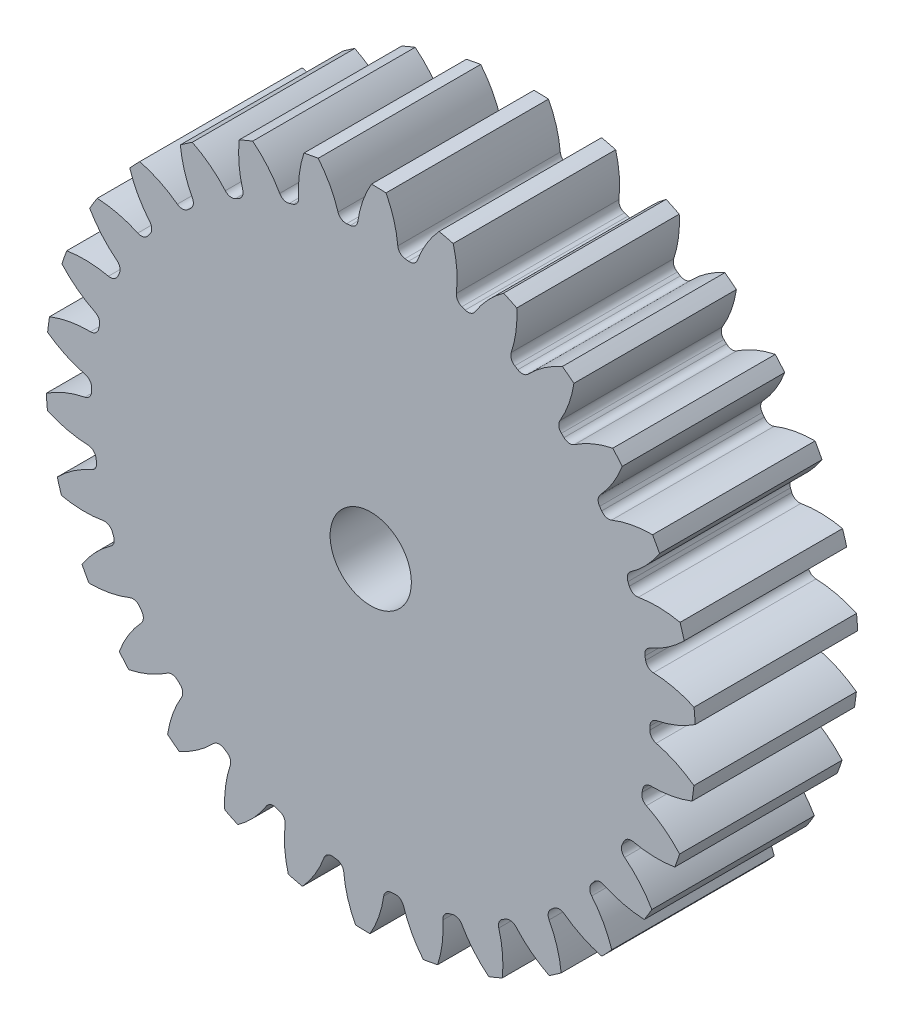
from build123d import *

# Parameters (mm, degrees)
SKETCH3_R         = 203.2
GEARBODY_DEPTH    = 101.6
TOOTHCUT_DEPTH    = 305.8
CIRPATTERN1_COUNT = 30
BOREDIA_R         = 25.4
BORE_DEPTH        = 12700


with BuildPart() as part:
    # Sketch3 → gearBody (new body)
    with BuildSketch(Plane.XY):
        Circle(SKETCH3_R)
    extrude(amount=GEARBODY_DEPTH)

    # Sketch2 → toothCut (cut, through all)
    with BuildSketch(Plane.XY):
        with BuildLine():
            ThreePointArc((174.540569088, -5.429582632), (174.571894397, -4.306310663), (174.595990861, -3.182860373))
            ThreePointArc((174.595990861, -3.182860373), (175.796233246, 0.035644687), (178.748788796, 1.79114243))
            ThreePointArc((178.748788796, 1.79114243), (191.472892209, 5.665923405), (203.2, 11.942202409))
            ThreePointArc((203.2, 11.942202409), (203.488720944, -5.019626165), (202.364036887, -21.946589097))
            ThreePointArc((202.364036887, -21.946589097), (190.96064848, -15.099730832), (178.443069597, -10.602292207))
            ThreePointArc((178.443069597, -10.602292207), (175.580661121, -8.703351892), (174.540569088, -5.429582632))
        make_face()
    toothcut = extrude(amount=TOOTHCUT_DEPTH, mode=Mode.SUBTRACT)

    # CirPattern1: toothCut ×30 about axis
    cirpattern1_axis = Axis((0, 0, 0), (0, 0, 1))
    for i in range(1, CIRPATTERN1_COUNT):
        add(toothcut.rotate(cirpattern1_axis, i * 360 / CIRPATTERN1_COUNT), mode=Mode.SUBTRACT)

    # boreDia → bore (cut, symmetric)
    with BuildSketch(Plane.XY):
        Circle(BOREDIA_R)
    extrude(amount=BORE_DEPTH, both=True, mode=Mode.SUBTRACT)


solid = part.part
